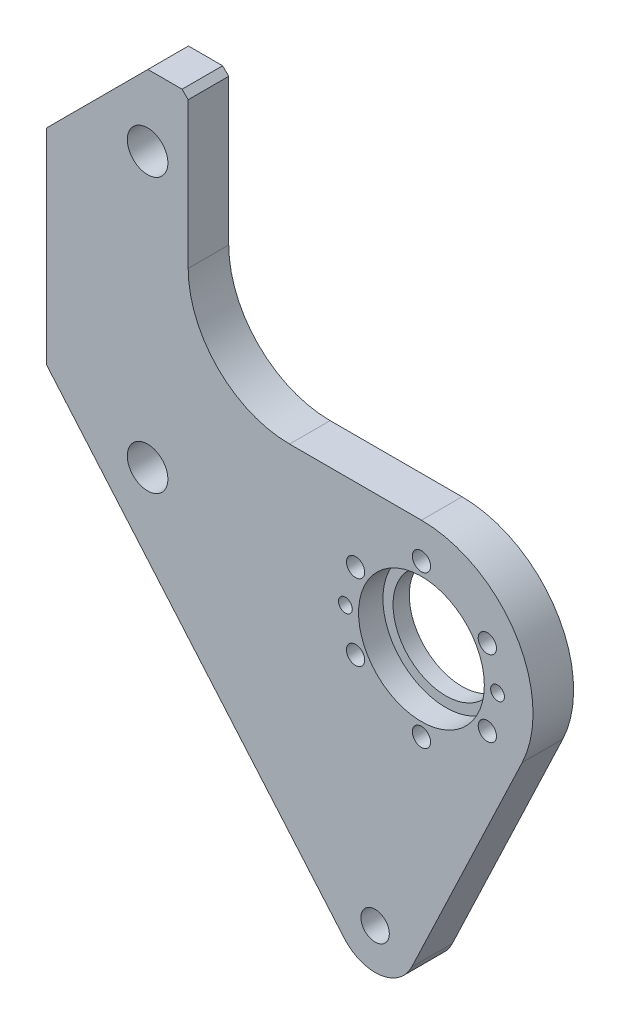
from build123d import *

# Parameters (mm, degrees)
ESQUISSE1_R                = 26
ESQUISSE1_R_2              = 10
BASE_EXTRUSION_DEPTH       = 20
CHANFREIN1_SIZE            = 3
TROU_TARAUD_M16X2_01_D     = 14
ESQUISSE3_R                = 4.5
ENL_V_MAT_EXTRU_1_DEPTH    = 20
TROU_TARAUD_M8X1_251_D     = 6.8
TROU_TARAUD_M8X1_251_DEPTH = 22.25
TROU_TARAUD_M8X1_251_TIP   = 2.042926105
ESQUISSE5_R                = 31
ENL_V_MAT_EXTRU_3_DEPTH    = 12


with BuildPart() as part:
    # Esquisse1 → Base-Extrusion (new body)
    with BuildSketch(Plane.XY):
        with BuildLine():
            Line((49.6691976, -23.621405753), (-4.7784736, -138.109602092))
            ThreePointArc((-4.7784736, -138.109602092), (-20.206834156, -149.345903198), (-38.033276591, -142.526319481))
            Line((-38.033276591, -142.526319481), (-184.869681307, 29))
            Line((-184.869681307, 29), (-184.869681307, 130))
            Line((-184.869681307, 130), (-134.869681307, 180))
            Line((-134.869681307, 180), (-115, 180))
            Line((-115, 180), (-115, 105))
            ThreePointArc((-115, 105), (-100.355339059, 69.644660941), (-65, 55))
            Line((-65, 55), (0, 55))
            ThreePointArc((0, 55), (46.49826511, 29.375352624), (49.6691976, -23.621405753))
        make_face()
        Circle(ESQUISSE1_R, mode=Mode.SUBTRACT)
        with Locations((-135, 10)):
            Circle(ESQUISSE1_R_2, mode=Mode.SUBTRACT)
        with Locations((-135, 145)):
            Circle(ESQUISSE1_R_2, mode=Mode.SUBTRACT)
    extrude(amount=-BASE_EXTRUSION_DEPTH)

    # Chanfrein1
    chanfrein1_edges = [part.edges().sort_by_distance(p)[0] for p in [
        (-115, 180, -10),
    ]]
    chamfer(chanfrein1_edges, length=CHANFREIN1_SIZE)

    # Trou taraud_ M16x2.01 (through all)
    with Locations(Plane(origin=(-22.84, -129.52, 0), x_dir=(1, 0, 0), z_dir=(0, 0, 1))):
        with Locations((0, 0)):
            Hole(TROU_TARAUD_M16X2_01_D / 2)

    # Esquisse3 → Enl_v. mat.-Extru.1 (cut)
    with BuildSketch(Plane.XY):
        with Locations((32.475952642, 18.75)):
            Circle(ESQUISSE3_R)
        with Locations((32.475952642, -18.75)):
            Circle(ESQUISSE3_R)
        with Locations((0, -37.5)):
            Circle(ESQUISSE3_R)
        with Locations((-32.475952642, -18.75)):
            Circle(ESQUISSE3_R)
        with Locations((-32.475952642, 18.75)):
            Circle(ESQUISSE3_R)
        with Locations((0, 37.5)):
            Circle(ESQUISSE3_R)
    extrude(amount=-ENL_V_MAT_EXTRU_1_DEPTH, mode=Mode.SUBTRACT)

    # Trou taraud_ M8x1.251
    with Locations(Plane(origin=(-37.5, 0, 0), x_dir=(1, 0, 0), z_dir=(0, 0, 1))):
        with Locations((0, 0), (75, 0)):
            Hole(TROU_TARAUD_M8X1_251_D / 2, depth=TROU_TARAUD_M8X1_251_DEPTH)
            with Locations((0, 0, -(TROU_TARAUD_M8X1_251_DEPTH + TROU_TARAUD_M8X1_251_TIP / 2))):  # 118° drill point
                Cone(0, TROU_TARAUD_M8X1_251_D / 2, TROU_TARAUD_M8X1_251_TIP, mode=Mode.SUBTRACT)

    # Esquisse5 → Enl_v. mat.-Extru.3 (cut)
    with BuildSketch(Plane.XY):
        Circle(ESQUISSE5_R)
    extrude(amount=-ENL_V_MAT_EXTRU_3_DEPTH, mode=Mode.SUBTRACT)


solid = part.part
